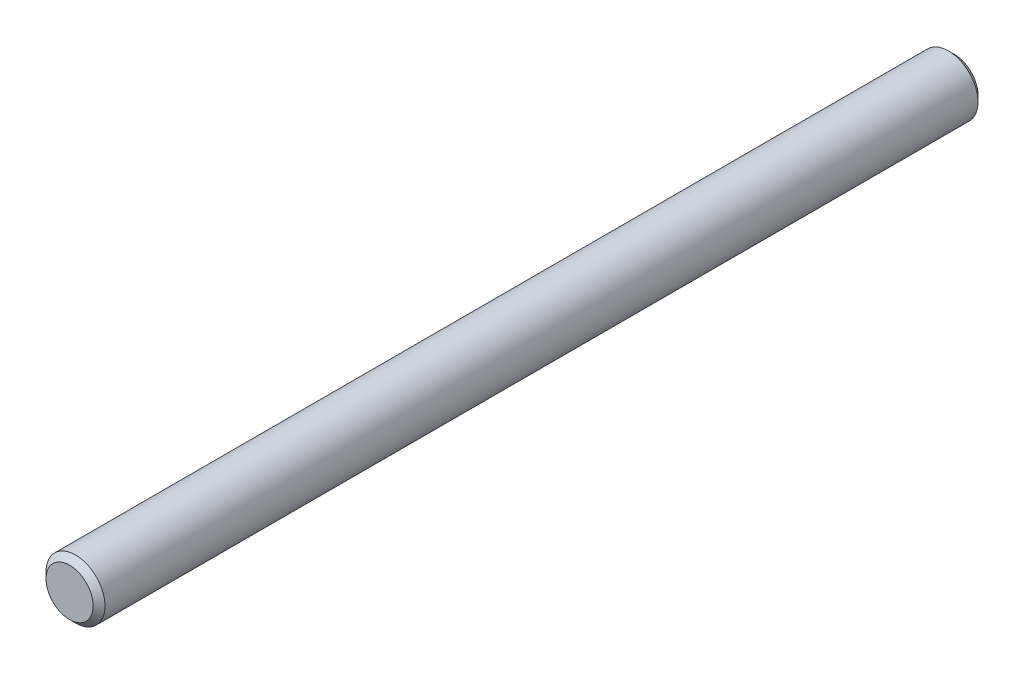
from build123d import *

# Parameters (mm, degrees)
ESQUISSE1_R        = 1
BOSS_EXTRU_1_DEPTH = 30
CHANFREIN1_SIZE    = 0.2


with BuildPart() as part:
    # Esquisse1 → Boss.-Extru.1 (new body)
    with BuildSketch(Plane.XY):
        Circle(ESQUISSE1_R)
    extrude(amount=BOSS_EXTRU_1_DEPTH)

    # Chanfrein1
    chanfrein1_edges = [part.edges().sort_by_distance(p)[0] for p in [
        (-1, 0, 0),
        (-1, 0, 30),
    ]]
    chamfer(chanfrein1_edges, length=CHANFREIN1_SIZE)


solid = part.part
